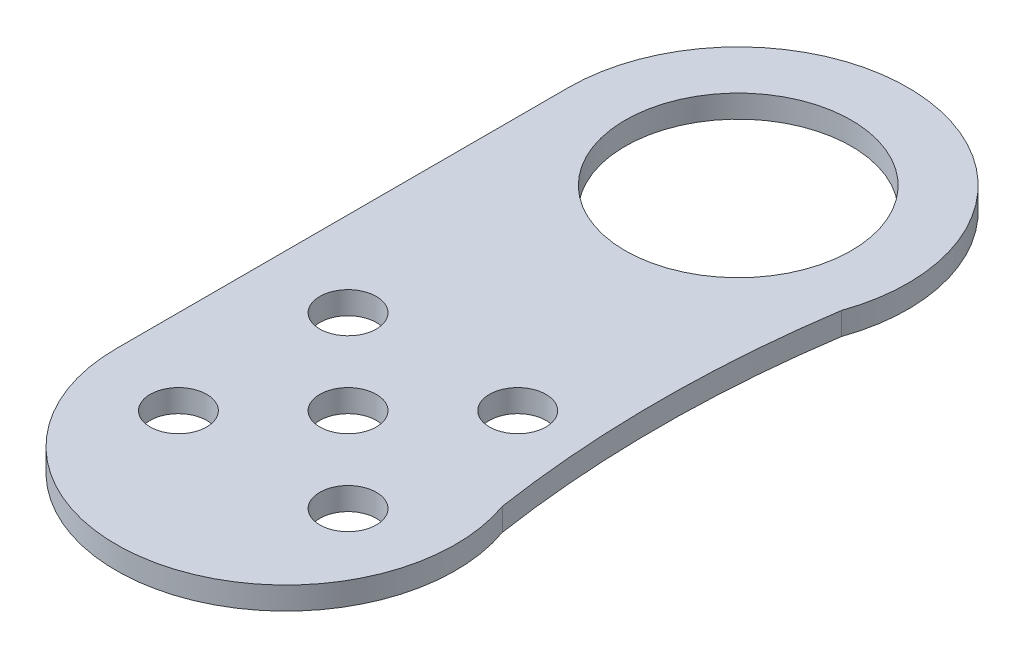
from build123d import *

# Parameters (mm, degrees)
BOSS_EXTRUDE1_DEPTH     = 2
CUT_EXTRUDE1_DEPTH      = 63.681735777
CUT_EXTRUDE1_DEPTH_BACK = 63.681735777
SKETCH2_R               = 10
SKETCH2_R_2             = 2.5


with BuildPart() as part:
    # Sketch1 → Boss-Extrude1 (new body)
    with BuildSketch(Plane(origin=(0, 0, 0), x_dir=(1, 0, 0), z_dir=(0, 1, 0))):
        with BuildLine():
            ThreePointArc((-0.857864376, 35), (-1.98926471, 20), (-0.857864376, 5))
            ThreePointArc((-0.857864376, 5), (-0.216021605, 2.536529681), (0, 0))
            ThreePointArc((0, 0), (-15, -15), (-30, 0))
            Line((-30, 0), (-30, 40))
            ThreePointArc((-30, 40), (-15, 55), (0, 40))
            ThreePointArc((0, 40), (-0.216021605, 37.463470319), (-0.857864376, 35))
        make_face()
    extrude(amount=BOSS_EXTRUDE1_DEPTH)

    # Sketch2 → Cut-Extrude1 (cut, two sides: drawn at the far end of the back side and taken through both)
    with BuildSketch(Plane(origin=(0, 2, 0), x_dir=(1, 0, 0), z_dir=(0, 1, 0)).offset(-CUT_EXTRUDE1_DEPTH_BACK)):
        with Locations(Location((-15, 40, 0), (0, 0, 270))):
            Circle(SKETCH2_R)
        with Locations(Location((-22.5, 13, 0), (0, 0, 270))):
            Circle(SKETCH2_R_2)
        with Locations(Location((-7.5, 13, 0), (0, 0, 270))):
            Circle(SKETCH2_R_2)
        with Locations(Location((-15, 5.5, 0), (0, 0, 270))):
            Circle(SKETCH2_R_2)
        with Locations(Location((-7.5, -2, 0), (0, 0, 270))):
            Circle(SKETCH2_R_2)
        with Locations(Location((-22.5, -2, 0), (0, 0, 270))):
            Circle(SKETCH2_R_2)
    extrude(amount=CUT_EXTRUDE1_DEPTH + CUT_EXTRUDE1_DEPTH_BACK, mode=Mode.SUBTRACT)


solid = part.part
